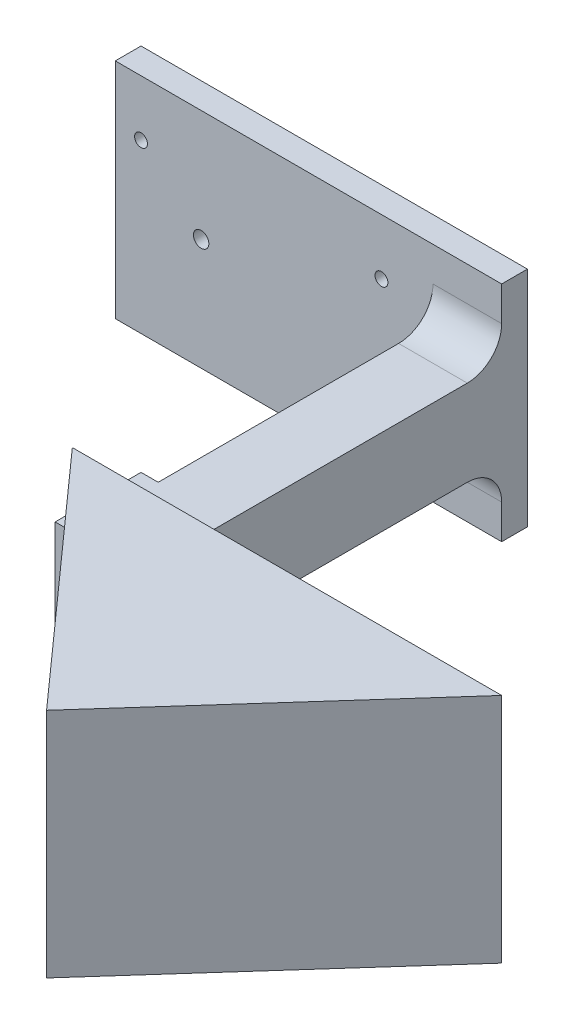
ISO-10303-21;
HEADER;
FILE_DESCRIPTION(('STEP AP214'),'2;1');
FILE_NAME('part.step','',(''),(''),'','','');
FILE_SCHEMA(('AUTOMOTIVE_DESIGN { 1 0 10303 214 1 1 1 1 }'));
ENDSEC;
DATA;
#1=APPLICATION_CONTEXT('core data for automotive mechanical design processes');
#2=APPLICATION_PROTOCOL_DEFINITION('international standard','automotive_design',2000,#1);
#3=PRODUCT_CONTEXT('',#1,'mechanical');
#4=PRODUCT('Part','Part','',(#3));
#5=PRODUCT_RELATED_PRODUCT_CATEGORY('part','',(#4));
#6=PRODUCT_DEFINITION_FORMATION('','',#4);
#7=PRODUCT_DEFINITION_CONTEXT('part definition',#1,'design');
#8=PRODUCT_DEFINITION('design','',#6,#7);
#9=PRODUCT_DEFINITION_SHAPE('','',#8);
#10=(LENGTH_UNIT() NAMED_UNIT(*) SI_UNIT(.MILLI.,.METRE.));
#11=(NAMED_UNIT(*) PLANE_ANGLE_UNIT() SI_UNIT($,.RADIAN.));
#12=(NAMED_UNIT(*) SI_UNIT($,.STERADIAN.) SOLID_ANGLE_UNIT());
#13=UNCERTAINTY_MEASURE_WITH_UNIT(LENGTH_MEASURE(1.E-05),#10,'distance_accuracy_value','');
#14=(GEOMETRIC_REPRESENTATION_CONTEXT(3) GLOBAL_UNCERTAINTY_ASSIGNED_CONTEXT((#13)) GLOBAL_UNIT_ASSIGNED_CONTEXT((#10,
#11,#12)) REPRESENTATION_CONTEXT('',''));
#15=CARTESIAN_POINT('',(0.,0.,0.));
#16=DIRECTION('',(0.,0.,1.));
#17=DIRECTION('',(1.,0.,0.));
#18=AXIS2_PLACEMENT_3D('',#15,#16,#17);
#19=CARTESIAN_POINT('',(37.,18.,45.));
#20=DIRECTION('',(1.,0.,0.));
#21=DIRECTION('',(0.,0.,-1.));
#22=AXIS2_PLACEMENT_3D('',#19,#20,#21);
#23=PLANE('',#22);
#24=DIRECTION('',(0.,0.,-1.));
#25=VECTOR('',#24,1.);
#26=CARTESIAN_POINT('',(37.,18.,45.));
#27=LINE('',#26,#25);
#28=CARTESIAN_POINT('',(37.,18.,45.));
#29=VERTEX_POINT('',#28);
#30=CARTESIAN_POINT('',(37.,18.,41.));
#31=VERTEX_POINT('',#30);
#32=EDGE_CURVE('E220',#29,#31,#27,.T.);
#33=ORIENTED_EDGE('',*,*,#32,.F.);
#34=DIRECTION('',(0.,-1.,0.));
#35=VECTOR('',#34,1.);
#36=CARTESIAN_POINT('',(37.,27.5,45.));
#37=LINE('',#36,#35);
#38=CARTESIAN_POINT('',(37.,22.,45.));
#39=VERTEX_POINT('',#38);
#40=EDGE_CURVE('E262',#39,#29,#37,.T.);
#41=ORIENTED_EDGE('',*,*,#40,.F.);
#42=CARTESIAN_POINT('',(37.,22.,41.));
#43=DIRECTION('',(1.,0.,0.));
#44=DIRECTION('',(0.,0.,-1.));
#45=AXIS2_PLACEMENT_3D('',#42,#43,#44);
#46=CIRCLE('',#45,4.);
#47=EDGE_CURVE('E430',#39,#31,#46,.T.);
#48=ORIENTED_EDGE('',*,*,#47,.T.);
#49=EDGE_LOOP('',(#33,#41,#48));
#50=FACE_BOUND('',#49,.T.);
#51=ADVANCED_FACE('F39',(#50),#23,.F.);
#52=DIRECTION('',(0.,0.,-1.));
#53=VECTOR('',#52,1.);
#54=CARTESIAN_POINT('',(37.,8.,45.));
#55=LINE('',#54,#53);
#56=CARTESIAN_POINT('',(37.,8.,35.));
#57=VERTEX_POINT('',#56);
#58=CARTESIAN_POINT('',(37.,8.,7.00000000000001));
#59=VERTEX_POINT('',#58);
#60=EDGE_CURVE('E297',#57,#59,#55,.T.);
#61=ORIENTED_EDGE('',*,*,#60,.F.);
#62=DIRECTION('',(0.,1.,0.));
#63=VECTOR('',#62,1.);
#64=CARTESIAN_POINT('',(37.,18.,35.));
#65=LINE('',#64,#63);
#66=CARTESIAN_POINT('',(37.,18.,35.));
#67=VERTEX_POINT('',#66);
#68=EDGE_CURVE('E62',#57,#67,#65,.T.);
#69=ORIENTED_EDGE('',*,*,#68,.T.);
#70=DIRECTION('',(0.,0.,-1.));
#71=VECTOR('',#70,1.);
#72=CARTESIAN_POINT('',(37.,18.,45.));
#73=LINE('',#72,#71);
#74=CARTESIAN_POINT('',(37.,18.,7.00000000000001));
#75=VERTEX_POINT('',#74);
#76=EDGE_CURVE('E205',#67,#75,#73,.T.);
#77=ORIENTED_EDGE('',*,*,#76,.T.);
#78=CARTESIAN_POINT('',(37.,22.,7.));
#79=DIRECTION('',(1.,0.,0.));
#80=DIRECTION('',(0.,0.,-1.));
#81=AXIS2_PLACEMENT_3D('',#78,#79,#80);
#82=CIRCLE('',#81,4.);
#83=CARTESIAN_POINT('',(37.,22.,3.));
#84=VERTEX_POINT('',#83);
#85=EDGE_CURVE('E576',#75,#84,#82,.T.);
#86=ORIENTED_EDGE('',*,*,#85,.T.);
#87=DIRECTION('',(0.,-1.,0.));
#88=VECTOR('',#87,1.);
#89=CARTESIAN_POINT('',(37.,18.,3.));
#90=LINE('',#89,#88);
#91=CARTESIAN_POINT('',(37.,4.,3.));
#92=VERTEX_POINT('',#91);
#93=EDGE_CURVE('E287',#84,#92,#90,.T.);
#94=ORIENTED_EDGE('',*,*,#93,.T.);
#95=CARTESIAN_POINT('',(37.,4.,7.));
#96=DIRECTION('',(1.,0.,0.));
#97=DIRECTION('',(0.,0.,-1.));
#98=AXIS2_PLACEMENT_3D('',#95,#96,#97);
#99=CIRCLE('',#98,4.);
#100=EDGE_CURVE('E580',#92,#59,#99,.T.);
#101=ORIENTED_EDGE('',*,*,#100,.T.);
#102=EDGE_LOOP('',(#61,#69,#77,#86,#94,#101));
#103=FACE_BOUND('',#102,.T.);
#104=ADVANCED_FACE('F468',(#103),#23,.F.);
#105=CARTESIAN_POINT('',(37.,8.,45.));
#106=DIRECTION('',(0.,1.,0.));
#107=DIRECTION('',(0.,0.,1.));
#108=AXIS2_PLACEMENT_3D('',#105,#106,#107);
#109=PLANE('',#108);
#110=DIRECTION('',(1.,0.,0.));
#111=VECTOR('',#110,1.);
#112=CARTESIAN_POINT('',(35.,8.,35.));
#113=LINE('',#112,#111);
#114=CARTESIAN_POINT('',(45.,8.,35.));
#115=VERTEX_POINT('',#114);
#116=EDGE_CURVE('E223',#57,#115,#113,.T.);
#117=ORIENTED_EDGE('',*,*,#116,.F.);
#118=ORIENTED_EDGE('',*,*,#60,.T.);
#119=DIRECTION('',(1.,0.,0.));
#120=VECTOR('',#119,1.);
#121=CARTESIAN_POINT('',(45.,8.,7.));
#122=LINE('',#121,#120);
#123=CARTESIAN_POINT('',(45.,8.,7.00000000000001));
#124=VERTEX_POINT('',#123);
#125=EDGE_CURVE('E401',#59,#124,#122,.T.);
#126=ORIENTED_EDGE('',*,*,#125,.T.);
#127=DIRECTION('',(0.,0.,-1.));
#128=VECTOR('',#127,1.);
#129=CARTESIAN_POINT('',(45.,8.,45.));
#130=LINE('',#129,#128);
#131=EDGE_CURVE('E55',#115,#124,#130,.T.);
#132=ORIENTED_EDGE('',*,*,#131,.F.);
#133=EDGE_LOOP('',(#117,#118,#126,#132));
#134=FACE_BOUND('',#133,.T.);
#135=ADVANCED_FACE('F474',(#134),#109,.F.);
#136=DIRECTION('',(0.,0.,1.));
#137=VECTOR('',#136,1.);
#138=CARTESIAN_POINT('',(45.,8.,45.));
#139=LINE('',#138,#137);
#140=CARTESIAN_POINT('',(45.,8.,40.));
#141=VERTEX_POINT('',#140);
#142=CARTESIAN_POINT('',(45.,8.,41.));
#143=VERTEX_POINT('',#142);
#144=EDGE_CURVE('E227',#141,#143,#139,.T.);
#145=ORIENTED_EDGE('',*,*,#144,.F.);
#146=CARTESIAN_POINT('',(50.,8.,40.));
#147=DIRECTION('',(0.,1.,0.));
#148=DIRECTION('',(0.,0.,1.));
#149=AXIS2_PLACEMENT_3D('',#146,#147,#148);
#150=CIRCLE('',#149,5.);
#151=CARTESIAN_POINT('',(45.1010205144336,8.,41.));
#152=VERTEX_POINT('',#151);
#153=EDGE_CURVE('E390',#141,#152,#150,.T.);
#154=ORIENTED_EDGE('',*,*,#153,.T.);
#155=DIRECTION('',(1.,0.,0.));
#156=VECTOR('',#155,1.);
#157=CARTESIAN_POINT('',(37.,8.,41.));
#158=LINE('',#157,#156);
#159=EDGE_CURVE('E404',#152,#143,#158,.F.);
#160=ORIENTED_EDGE('',*,*,#159,.T.);
#161=EDGE_LOOP('',(#145,#154,#160));
#162=FACE_BOUND('',#161,.T.);
#163=ADVANCED_FACE('F550',(#162),#109,.F.);
#164=CARTESIAN_POINT('',(0.,0.,45.));
#165=DIRECTION('',(0.,0.,1.));
#166=DIRECTION('',(1.,0.,0.));
#167=AXIS2_PLACEMENT_3D('',#164,#165,#166);
#168=PLANE('',#167);
#169=DIRECTION('',(0.,1.,0.));
#170=VECTOR('',#169,1.);
#171=CARTESIAN_POINT('',(45.,-3.,45.));
#172=LINE('',#171,#170);
#173=CARTESIAN_POINT('',(45.,-0.5,45.));
#174=VERTEX_POINT('',#173);
#175=CARTESIAN_POINT('',(45.,4.,45.));
#176=VERTEX_POINT('',#175);
#177=EDGE_CURVE('E243',#174,#176,#172,.T.);
#178=ORIENTED_EDGE('',*,*,#177,.T.);
#179=DIRECTION('',(1.,0.,0.));
#180=VECTOR('',#179,1.);
#181=CARTESIAN_POINT('',(50.,4.,45.));
#182=LINE('',#181,#180);
#183=CARTESIAN_POINT('',(50.,4.,45.));
#184=VERTEX_POINT('',#183);
#185=EDGE_CURVE('E398',#176,#184,#182,.T.);
#186=ORIENTED_EDGE('',*,*,#185,.T.);
#187=DIRECTION('',(0.,1.,0.));
#188=VECTOR('',#187,1.);
#189=CARTESIAN_POINT('',(50.,18.,45.));
#190=LINE('',#189,#188);
#191=CARTESIAN_POINT('',(50.,22.,45.));
#192=VERTEX_POINT('',#191);
#193=EDGE_CURVE('E380',#184,#192,#190,.T.);
#194=ORIENTED_EDGE('',*,*,#193,.T.);
#195=DIRECTION('',(-1.,0.,0.));
#196=VECTOR('',#195,1.);
#197=CARTESIAN_POINT('',(37.,22.,45.));
#198=LINE('',#197,#196);
#199=EDGE_CURVE('E394',#192,#39,#198,.T.);
#200=ORIENTED_EDGE('',*,*,#199,.T.);
#201=DIRECTION('',(0.,-1.,0.));
#202=VECTOR('',#201,1.);
#203=CARTESIAN_POINT('',(37.,26.5,45.));
#204=LINE('',#203,#202);
#205=CARTESIAN_POINT('',(37.,26.5,45.));
#206=VERTEX_POINT('',#205);
#207=EDGE_CURVE('E271',#206,#39,#204,.T.);
#208=ORIENTED_EDGE('',*,*,#207,.F.);
#209=DIRECTION('',(-1.,0.,0.));
#210=VECTOR('',#209,1.);
#211=CARTESIAN_POINT('',(37.,26.5,45.));
#212=LINE('',#211,#210);
#213=CARTESIAN_POINT('',(87.,26.5,45.));
#214=VERTEX_POINT('',#213);
#215=EDGE_CURVE('E283',#214,#206,#212,.T.);
#216=ORIENTED_EDGE('',*,*,#215,.F.);
#217=DIRECTION('',(0.,1.,0.));
#218=VECTOR('',#217,1.);
#219=CARTESIAN_POINT('',(87.,26.5,45.));
#220=LINE('',#219,#218);
#221=CARTESIAN_POINT('',(87.,-0.5,45.));
#222=VERTEX_POINT('',#221);
#223=EDGE_CURVE('E280',#222,#214,#220,.T.);
#224=ORIENTED_EDGE('',*,*,#223,.F.);
#225=DIRECTION('',(1.,0.,0.));
#226=VECTOR('',#225,1.);
#227=CARTESIAN_POINT('',(37.,-0.5,45.));
#228=LINE('',#227,#226);
#229=EDGE_CURVE('E275',#174,#222,#228,.T.);
#230=ORIENTED_EDGE('',*,*,#229,.F.);
#231=EDGE_LOOP('',(#178,#186,#194,#200,#208,#216,#224,#230));
#232=FACE_BOUND('',#231,.T.);
#233=ADVANCED_FACE('F542',(#232),#168,.F.);
#234=CARTESIAN_POINT('',(0.,4.,41.));
#235=DIRECTION('',(-1.,0.,0.));
#236=DIRECTION('',(0.,0.,1.));
#237=AXIS2_PLACEMENT_3D('',#234,#235,#236);
#238=CYLINDRICAL_SURFACE('',#237,4.);
#239=CARTESIAN_POINT('',(45.,4.,41.));
#240=DIRECTION('',(-1.,0.,0.));
#241=DIRECTION('',(0.,0.,1.));
#242=AXIS2_PLACEMENT_3D('',#239,#240,#241);
#243=CIRCLE('',#242,4.);
#244=EDGE_CURVE('E11',#143,#176,#243,.F.);
#245=ORIENTED_EDGE('',*,*,#244,.F.);
#246=ORIENTED_EDGE('',*,*,#159,.F.);
#247=CARTESIAN_POINT('',(45.1010205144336,8.,41.));
#248=CARTESIAN_POINT('',(45.1219581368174,8.00002148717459,41.1027017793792));
#249=CARTESIAN_POINT('',(45.1461658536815,7.99604592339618,41.2046920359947));
#250=CARTESIAN_POINT('',(45.2007183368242,7.98058689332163,41.4063145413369));
#251=CARTESIAN_POINT('',(45.2310558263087,7.96911229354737,41.5059494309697));
#252=CARTESIAN_POINT('',(45.2972108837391,7.93927673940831,41.7012719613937));
#253=CARTESIAN_POINT('',(45.332975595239,7.92097996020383,41.7969874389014));
#254=CARTESIAN_POINT('',(45.4097149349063,7.87806419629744,41.9848403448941));
#255=CARTESIAN_POINT('',(45.4506909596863,7.85344351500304,42.0769768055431));
#256=CARTESIAN_POINT('',(45.5802965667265,7.77123638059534,42.3464299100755));
#257=CARTESIAN_POINT('',(45.6759740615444,7.70512970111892,42.5178634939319));
#258=CARTESIAN_POINT('',(45.8823757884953,7.55467704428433,42.8429707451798));
#259=CARTESIAN_POINT('',(45.9931390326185,7.47028343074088,42.9965963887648));
#260=CARTESIAN_POINT('',(46.2884681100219,7.23850961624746,43.3623429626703));
#261=CARTESIAN_POINT('',(46.4809432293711,7.0815090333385,43.5620916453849));
#262=CARTESIAN_POINT('',(46.7830960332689,6.82941253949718,43.8301146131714));
#263=CARTESIAN_POINT('',(46.8862185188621,6.74247147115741,43.9142913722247));
#264=CARTESIAN_POINT('',(47.0962268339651,6.56395665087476,44.0725124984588));
#265=CARTESIAN_POINT('',(47.2031126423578,6.472382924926,44.146556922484));
#266=CARTESIAN_POINT('',(47.4601841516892,6.25077587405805,44.3105047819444));
#267=CARTESIAN_POINT('',(47.6117053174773,6.11909219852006,44.3960820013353));
#268=CARTESIAN_POINT('',(47.9189902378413,5.85047083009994,44.5496051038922));
#269=CARTESIAN_POINT('',(48.07475552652,5.71353122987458,44.6175445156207));
#270=CARTESIAN_POINT('',(48.3891939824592,5.43598395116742,44.7364036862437));
#271=CARTESIAN_POINT('',(48.5478643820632,5.29537971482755,44.7873388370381));
#272=CARTESIAN_POINT('',(48.8672162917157,5.01164100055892,44.8727953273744));
#273=CARTESIAN_POINT('',(49.0278975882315,4.86850679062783,44.9073183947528));
#274=CARTESIAN_POINT('',(49.4548549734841,4.4875876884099,44.9774728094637));
#275=CARTESIAN_POINT('',(49.7223206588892,4.24836389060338,44.9994259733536));
#276=CARTESIAN_POINT('',(49.9929727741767,4.00628534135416,44.9999962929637));
#277=CARTESIAN_POINT('',(49.9964864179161,4.00314264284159,44.9999999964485));
#278=CARTESIAN_POINT('',(50.,4.,45.));
#279=B_SPLINE_CURVE_WITH_KNOTS('',3,(#247,#248,#249,#250,#251,#252,#253,#254,#255,#256,#257,
#258,#259,#260,#261,#262,#263,#264,#265,#266,#267,#268,#269,#270,#271,#272,#273,#274,#275,#276,
#277,#278),.UNSPECIFIED.,.F.,.F.,(4,2,2,2,2,2,2,2,2,2,2,2,2,2,2,4),(0.,0.314249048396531,
0.628127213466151,0.93912435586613,1.25020502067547,1.8689625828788,2.48935176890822,
3.43985889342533,3.91654501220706,4.39322845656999,5.04698520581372,5.70098148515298,
6.35438416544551,7.00771804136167,8.08291184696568,8.09705398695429),.UNSPECIFIED.);
#280=EDGE_CURVE('E421',#184,#152,#279,.F.);
#281=ORIENTED_EDGE('',*,*,#280,.F.);
#282=ORIENTED_EDGE('',*,*,#185,.F.);
#283=EDGE_LOOP('',(#245,#246,#281,#282));
#284=FACE_BOUND('',#283,.T.);
#285=ADVANCED_FACE('F432',(#284),#238,.F.);
#286=CARTESIAN_POINT('',(0.,0.,3.));
#287=DIRECTION('',(0.,0.,-1.));
#288=DIRECTION('',(-1.,0.,0.));
#289=AXIS2_PLACEMENT_3D('',#286,#287,#288);
#290=PLANE('',#289);
#291=CARTESIAN_POINT('',(3.,19.5,3.));
#292=DIRECTION('',(0.,0.,1.));
#293=DIRECTION('',(1.,0.,0.));
#294=AXIS2_PLACEMENT_3D('',#291,#292,#293);
#295=CIRCLE('',#294,0.75);
#296=CARTESIAN_POINT('',(3.75,19.5,3.));
#297=VERTEX_POINT('',#296);
#298=EDGE_CURVE('E301',#297,#297,#295,.T.);
#299=ORIENTED_EDGE('',*,*,#298,.F.);
#300=EDGE_LOOP('',(#299));
#301=FACE_BOUND('',#300,.T.);
#302=CARTESIAN_POINT('',(31.,19.5,3.));
#303=DIRECTION('',(0.,0.,1.));
#304=DIRECTION('',(1.,0.,0.));
#305=AXIS2_PLACEMENT_3D('',#302,#303,#304);
#306=CIRCLE('',#305,0.749999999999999);
#307=CARTESIAN_POINT('',(31.75,19.5,3.));
#308=VERTEX_POINT('',#307);
#309=EDGE_CURVE('E309',#308,#308,#306,.T.);
#310=ORIENTED_EDGE('',*,*,#309,.F.);
#311=EDGE_LOOP('',(#310));
#312=FACE_BOUND('',#311,.T.);
#313=CARTESIAN_POINT('',(34.,13.,3.));
#314=DIRECTION('',(0.,0.,1.));
#315=DIRECTION('',(1.,0.,0.));
#316=AXIS2_PLACEMENT_3D('',#313,#314,#315);
#317=CIRCLE('',#316,0.899999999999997);
#318=CARTESIAN_POINT('',(34.9,13.,3.));
#319=VERTEX_POINT('',#318);
#320=EDGE_CURVE('E317',#319,#319,#317,.T.);
#321=ORIENTED_EDGE('',*,*,#320,.F.);
#322=EDGE_LOOP('',(#321));
#323=FACE_BOUND('',#322,.T.);
#324=CARTESIAN_POINT('',(10.,13.,3.));
#325=DIRECTION('',(0.,0.,1.));
#326=DIRECTION('',(1.,0.,0.));
#327=AXIS2_PLACEMENT_3D('',#324,#325,#326);
#328=CIRCLE('',#327,0.900000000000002);
#329=CARTESIAN_POINT('',(10.9,13.,3.));
#330=VERTEX_POINT('',#329);
#331=EDGE_CURVE('E325',#330,#330,#328,.T.);
#332=ORIENTED_EDGE('',*,*,#331,.F.);
#333=EDGE_LOOP('',(#332));
#334=FACE_BOUND('',#333,.T.);
#335=DIRECTION('',(0.,1.,0.));
#336=VECTOR('',#335,1.);
#337=CARTESIAN_POINT('',(45.,0.,3.));
#338=LINE('',#337,#336);
#339=CARTESIAN_POINT('',(45.,0.,3.));
#340=VERTEX_POINT('',#339);
#341=CARTESIAN_POINT('',(45.,4.,3.));
#342=VERTEX_POINT('',#341);
#343=EDGE_CURVE('E342',#340,#342,#338,.T.);
#344=ORIENTED_EDGE('',*,*,#343,.T.);
#345=DIRECTION('',(1.,0.,0.));
#346=VECTOR('',#345,1.);
#347=CARTESIAN_POINT('',(37.,4.,3.));
#348=LINE('',#347,#346);
#349=EDGE_CURVE('E417',#342,#92,#348,.F.);
#350=ORIENTED_EDGE('',*,*,#349,.T.);
#351=ORIENTED_EDGE('',*,*,#93,.F.);
#352=DIRECTION('',(-1.,0.,0.));
#353=VECTOR('',#352,1.);
#354=CARTESIAN_POINT('',(45.,22.,3.));
#355=LINE('',#354,#353);
#356=CARTESIAN_POINT('',(45.,22.,3.));
#357=VERTEX_POINT('',#356);
#358=EDGE_CURVE('E414',#84,#357,#355,.F.);
#359=ORIENTED_EDGE('',*,*,#358,.T.);
#360=CARTESIAN_POINT('',(45.,26.,3.));
#361=VERTEX_POINT('',#360);
#362=EDGE_CURVE('E341',#357,#361,#338,.T.);
#363=ORIENTED_EDGE('',*,*,#362,.T.);
#364=DIRECTION('',(-1.,0.,0.));
#365=VECTOR('',#364,1.);
#366=CARTESIAN_POINT('',(0.,26.,3.));
#367=LINE('',#366,#365);
#368=CARTESIAN_POINT('',(0.,26.,3.));
#369=VERTEX_POINT('',#368);
#370=EDGE_CURVE('E346',#361,#369,#367,.T.);
#371=ORIENTED_EDGE('',*,*,#370,.T.);
#372=DIRECTION('',(0.,-1.,0.));
#373=VECTOR('',#372,1.);
#374=CARTESIAN_POINT('',(0.,0.,3.));
#375=LINE('',#374,#373);
#376=CARTESIAN_POINT('',(0.,0.,3.));
#377=VERTEX_POINT('',#376);
#378=EDGE_CURVE('E333',#369,#377,#375,.T.);
#379=ORIENTED_EDGE('',*,*,#378,.T.);
#380=DIRECTION('',(1.,0.,0.));
#381=VECTOR('',#380,1.);
#382=CARTESIAN_POINT('',(0.,0.,3.));
#383=LINE('',#382,#381);
#384=EDGE_CURVE('E337',#377,#340,#383,.T.);
#385=ORIENTED_EDGE('',*,*,#384,.T.);
#386=EDGE_LOOP('',(#344,#350,#351,#359,#363,#371,#379,#385));
#387=FACE_BOUND('',#386,.T.);
#388=ADVANCED_FACE('F497',(#301,#312,#323,#334,#387),#290,.F.);
#389=CARTESIAN_POINT('',(0.,0.,0.));
#390=DIRECTION('',(0.,0.,-1.));
#391=DIRECTION('',(-1.,0.,0.));
#392=AXIS2_PLACEMENT_3D('',#389,#390,#391);
#393=PLANE('',#392);
#394=CARTESIAN_POINT('',(31.,19.5,0.));
#395=DIRECTION('',(0.,0.,1.));
#396=DIRECTION('',(1.,0.,0.));
#397=AXIS2_PLACEMENT_3D('',#394,#395,#396);
#398=CIRCLE('',#397,0.749999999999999);
#399=CARTESIAN_POINT('',(31.75,19.5,0.));
#400=VERTEX_POINT('',#399);
#401=EDGE_CURVE('E305',#400,#400,#398,.T.);
#402=ORIENTED_EDGE('',*,*,#401,.T.);
#403=EDGE_LOOP('',(#402));
#404=FACE_BOUND('',#403,.T.);
#405=CARTESIAN_POINT('',(10.,13.,0.));
#406=DIRECTION('',(0.,0.,1.));
#407=DIRECTION('',(1.,0.,0.));
#408=AXIS2_PLACEMENT_3D('',#405,#406,#407);
#409=CIRCLE('',#408,0.900000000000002);
#410=CARTESIAN_POINT('',(10.9,13.,0.));
#411=VERTEX_POINT('',#410);
#412=EDGE_CURVE('E321',#411,#411,#409,.T.);
#413=ORIENTED_EDGE('',*,*,#412,.T.);
#414=EDGE_LOOP('',(#413));
#415=FACE_BOUND('',#414,.T.);
#416=DIRECTION('',(0.,-1.,0.));
#417=VECTOR('',#416,1.);
#418=CARTESIAN_POINT('',(0.,0.,0.));
#419=LINE('',#418,#417);
#420=CARTESIAN_POINT('',(0.,26.,0.));
#421=VERTEX_POINT('',#420);
#422=CARTESIAN_POINT('',(0.,0.,0.));
#423=VERTEX_POINT('',#422);
#424=EDGE_CURVE('E329',#421,#423,#419,.T.);
#425=ORIENTED_EDGE('',*,*,#424,.F.);
#426=DIRECTION('',(-1.,0.,0.));
#427=VECTOR('',#426,1.);
#428=CARTESIAN_POINT('',(0.,26.,0.));
#429=LINE('',#428,#427);
#430=CARTESIAN_POINT('',(45.,26.,0.));
#431=VERTEX_POINT('',#430);
#432=EDGE_CURVE('E338',#431,#421,#429,.T.);
#433=ORIENTED_EDGE('',*,*,#432,.F.);
#434=DIRECTION('',(0.,1.,0.));
#435=VECTOR('',#434,1.);
#436=CARTESIAN_POINT('',(45.,0.,0.));
#437=LINE('',#436,#435);
#438=CARTESIAN_POINT('',(45.,0.,0.));
#439=VERTEX_POINT('',#438);
#440=EDGE_CURVE('E356',#439,#431,#437,.T.);
#441=ORIENTED_EDGE('',*,*,#440,.F.);
#442=DIRECTION('',(1.,0.,0.));
#443=VECTOR('',#442,1.);
#444=CARTESIAN_POINT('',(0.,0.,0.));
#445=LINE('',#444,#443);
#446=EDGE_CURVE('E353',#423,#439,#445,.T.);
#447=ORIENTED_EDGE('',*,*,#446,.F.);
#448=EDGE_LOOP('',(#425,#433,#441,#447));
#449=FACE_BOUND('',#448,.T.);
#450=CARTESIAN_POINT('',(34.,13.,0.));
#451=DIRECTION('',(0.,0.,1.));
#452=DIRECTION('',(1.,0.,0.));
#453=AXIS2_PLACEMENT_3D('',#450,#451,#452);
#454=CIRCLE('',#453,0.899999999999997);
#455=CARTESIAN_POINT('',(34.9,13.,0.));
#456=VERTEX_POINT('',#455);
#457=EDGE_CURVE('E313',#456,#456,#454,.T.);
#458=ORIENTED_EDGE('',*,*,#457,.T.);
#459=EDGE_LOOP('',(#458));
#460=FACE_BOUND('',#459,.T.);
#461=CARTESIAN_POINT('',(3.,19.5,0.));
#462=DIRECTION('',(0.,0.,1.));
#463=DIRECTION('',(1.,0.,0.));
#464=AXIS2_PLACEMENT_3D('',#461,#462,#463);
#465=CIRCLE('',#464,0.75);
#466=CARTESIAN_POINT('',(3.75,19.5,0.));
#467=VERTEX_POINT('',#466);
#468=EDGE_CURVE('E300',#467,#467,#465,.T.);
#469=ORIENTED_EDGE('',*,*,#468,.T.);
#470=EDGE_LOOP('',(#469));
#471=FACE_BOUND('',#470,.T.);
#472=ADVANCED_FACE('F500',(#404,#415,#449,#460,#471),#393,.T.);
#473=CARTESIAN_POINT('',(0.,0.,3.));
#474=DIRECTION('',(1.,0.,0.));
#475=DIRECTION('',(0.,0.,-1.));
#476=AXIS2_PLACEMENT_3D('',#473,#474,#475);
#477=PLANE('',#476);
#478=ORIENTED_EDGE('',*,*,#424,.T.);
#479=DIRECTION('',(0.,0.,-1.));
#480=VECTOR('',#479,1.);
#481=CARTESIAN_POINT('',(0.,0.,3.));
#482=LINE('',#481,#480);
#483=EDGE_CURVE('E372',#377,#423,#482,.T.);
#484=ORIENTED_EDGE('',*,*,#483,.F.);
#485=ORIENTED_EDGE('',*,*,#378,.F.);
#486=DIRECTION('',(0.,0.,-1.));
#487=VECTOR('',#486,1.);
#488=CARTESIAN_POINT('',(0.,26.,3.));
#489=LINE('',#488,#487);
#490=EDGE_CURVE('E349',#369,#421,#489,.T.);
#491=ORIENTED_EDGE('',*,*,#490,.T.);
#492=EDGE_LOOP('',(#478,#484,#485,#491));
#493=FACE_BOUND('',#492,.T.);
#494=ADVANCED_FACE('F442',(#493),#477,.F.);
#495=CARTESIAN_POINT('',(0.,0.,3.));
#496=DIRECTION('',(0.,1.,0.));
#497=DIRECTION('',(0.,0.,1.));
#498=AXIS2_PLACEMENT_3D('',#495,#496,#497);
#499=PLANE('',#498);
#500=ORIENTED_EDGE('',*,*,#446,.T.);
#501=DIRECTION('',(0.,0.,-1.));
#502=VECTOR('',#501,1.);
#503=CARTESIAN_POINT('',(45.,0.,3.));
#504=LINE('',#503,#502);
#505=EDGE_CURVE('E368',#340,#439,#504,.T.);
#506=ORIENTED_EDGE('',*,*,#505,.F.);
#507=ORIENTED_EDGE('',*,*,#384,.F.);
#508=ORIENTED_EDGE('',*,*,#483,.T.);
#509=EDGE_LOOP('',(#500,#506,#507,#508));
#510=FACE_BOUND('',#509,.T.);
#511=ADVANCED_FACE('F510',(#510),#499,.F.);
#512=CARTESIAN_POINT('',(45.,0.,3.));
#513=DIRECTION('',(-1.,0.,0.));
#514=DIRECTION('',(0.,0.,1.));
#515=AXIS2_PLACEMENT_3D('',#512,#513,#514);
#516=PLANE('',#515);
#517=DIRECTION('',(0.,1.,0.));
#518=VECTOR('',#517,1.);
#519=CARTESIAN_POINT('',(45.,-3.,35.));
#520=LINE('',#519,#518);
#521=CARTESIAN_POINT('',(45.,-3.,35.));
#522=VERTEX_POINT('',#521);
#523=EDGE_CURVE('E196',#522,#115,#520,.T.);
#524=ORIENTED_EDGE('',*,*,#523,.T.);
#525=ORIENTED_EDGE('',*,*,#131,.T.);
#526=CARTESIAN_POINT('',(45.,4.,7.));
#527=DIRECTION('',(-1.,0.,0.));
#528=DIRECTION('',(0.,0.,1.));
#529=AXIS2_PLACEMENT_3D('',#526,#527,#528);
#530=CIRCLE('',#529,4.);
#531=EDGE_CURVE('E453',#124,#342,#530,.T.);
#532=ORIENTED_EDGE('',*,*,#531,.T.);
#533=ORIENTED_EDGE('',*,*,#343,.F.);
#534=ORIENTED_EDGE('',*,*,#505,.T.);
#535=ORIENTED_EDGE('',*,*,#440,.T.);
#536=DIRECTION('',(0.,0.,-1.));
#537=VECTOR('',#536,1.);
#538=CARTESIAN_POINT('',(45.,26.,3.));
#539=LINE('',#538,#537);
#540=EDGE_CURVE('E364',#361,#431,#539,.T.);
#541=ORIENTED_EDGE('',*,*,#540,.F.);
#542=ORIENTED_EDGE('',*,*,#362,.F.);
#543=CARTESIAN_POINT('',(45.,22.,7.));
#544=DIRECTION('',(-1.,0.,0.));
#545=DIRECTION('',(0.,0.,1.));
#546=AXIS2_PLACEMENT_3D('',#543,#544,#545);
#547=CIRCLE('',#546,4.);
#548=CARTESIAN_POINT('',(45.,18.,7.00000000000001));
#549=VERTEX_POINT('',#548);
#550=EDGE_CURVE('E48',#357,#549,#547,.T.);
#551=ORIENTED_EDGE('',*,*,#550,.T.);
#552=DIRECTION('',(0.,0.,-1.));
#553=VECTOR('',#552,1.);
#554=CARTESIAN_POINT('',(45.,18.,45.));
#555=LINE('',#554,#553);
#556=CARTESIAN_POINT('',(45.,18.,40.));
#557=VERTEX_POINT('',#556);
#558=EDGE_CURVE('E292',#557,#549,#555,.T.);
#559=ORIENTED_EDGE('',*,*,#558,.F.);
#560=DIRECTION('',(0.,1.,0.));
#561=VECTOR('',#560,1.);
#562=CARTESIAN_POINT('',(45.,8.,40.));
#563=LINE('',#562,#561);
#564=EDGE_CURVE('E383',#557,#141,#563,.F.);
#565=ORIENTED_EDGE('',*,*,#564,.T.);
#566=ORIENTED_EDGE('',*,*,#144,.T.);
#567=ORIENTED_EDGE('',*,*,#244,.T.);
#568=ORIENTED_EDGE('',*,*,#177,.F.);
#569=CARTESIAN_POINT('',(45.,-3.,45.));
#570=VERTEX_POINT('',#569);
#571=EDGE_CURVE('E244',#570,#174,#172,.T.);
#572=ORIENTED_EDGE('',*,*,#571,.F.);
#573=DIRECTION('',(0.,0.,1.));
#574=VECTOR('',#573,1.);
#575=CARTESIAN_POINT('',(45.,-3.,45.));
#576=LINE('',#575,#574);
#577=EDGE_CURVE('E230',#522,#570,#576,.T.);
#578=ORIENTED_EDGE('',*,*,#577,.F.);
#579=EDGE_LOOP('',(#524,#525,#532,#533,#534,#535,#541,#542,#551,#559,#565,#566,#567,#568,#572,#578));
#580=FACE_BOUND('',#579,.T.);
#581=ADVANCED_FACE('F507',(#580),#516,.F.);
#582=CARTESIAN_POINT('',(0.,26.,3.));
#583=DIRECTION('',(0.,-1.,0.));
#584=DIRECTION('',(0.,0.,-1.));
#585=AXIS2_PLACEMENT_3D('',#582,#583,#584);
#586=PLANE('',#585);
#587=ORIENTED_EDGE('',*,*,#432,.T.);
#588=ORIENTED_EDGE('',*,*,#490,.F.);
#589=ORIENTED_EDGE('',*,*,#370,.F.);
#590=ORIENTED_EDGE('',*,*,#540,.T.);
#591=EDGE_LOOP('',(#587,#588,#589,#590));
#592=FACE_BOUND('',#591,.T.);
#593=ADVANCED_FACE('F495',(#592),#586,.F.);
#594=CARTESIAN_POINT('',(10.,13.,3.));
#595=DIRECTION('',(0.,0.,-1.));
#596=DIRECTION('',(-1.,0.,0.));
#597=AXIS2_PLACEMENT_3D('',#594,#595,#596);
#598=CYLINDRICAL_SURFACE('',#597,0.900000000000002);
#599=ORIENTED_EDGE('',*,*,#331,.T.);
#600=EDGE_LOOP('',(#599));
#601=FACE_BOUND('',#600,.T.);
#602=ORIENTED_EDGE('',*,*,#412,.F.);
#603=EDGE_LOOP('',(#602));
#604=FACE_BOUND('',#603,.T.);
#605=ADVANCED_FACE('F491',(#601,#604),#598,.F.);
#606=CARTESIAN_POINT('',(34.,13.,3.));
#607=DIRECTION('',(0.,0.,-1.));
#608=DIRECTION('',(-1.,0.,0.));
#609=AXIS2_PLACEMENT_3D('',#606,#607,#608);
#610=CYLINDRICAL_SURFACE('',#609,0.899999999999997);
#611=ORIENTED_EDGE('',*,*,#320,.T.);
#612=EDGE_LOOP('',(#611));
#613=FACE_BOUND('',#612,.T.);
#614=ORIENTED_EDGE('',*,*,#457,.F.);
#615=EDGE_LOOP('',(#614));
#616=FACE_BOUND('',#615,.T.);
#617=ADVANCED_FACE('F487',(#613,#616),#610,.F.);
#618=CARTESIAN_POINT('',(31.,19.5,3.));
#619=DIRECTION('',(0.,0.,-1.));
#620=DIRECTION('',(-1.,0.,0.));
#621=AXIS2_PLACEMENT_3D('',#618,#619,#620);
#622=CYLINDRICAL_SURFACE('',#621,0.749999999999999);
#623=ORIENTED_EDGE('',*,*,#309,.T.);
#624=EDGE_LOOP('',(#623));
#625=FACE_BOUND('',#624,.T.);
#626=ORIENTED_EDGE('',*,*,#401,.F.);
#627=EDGE_LOOP('',(#626));
#628=FACE_BOUND('',#627,.T.);
#629=ADVANCED_FACE('F483',(#625,#628),#622,.F.);
#630=CARTESIAN_POINT('',(3.,19.5,3.));
#631=DIRECTION('',(0.,0.,-1.));
#632=DIRECTION('',(-1.,0.,0.));
#633=AXIS2_PLACEMENT_3D('',#630,#631,#632);
#634=CYLINDRICAL_SURFACE('',#633,0.75);
#635=ORIENTED_EDGE('',*,*,#298,.T.);
#636=EDGE_LOOP('',(#635));
#637=FACE_BOUND('',#636,.T.);
#638=ORIENTED_EDGE('',*,*,#468,.F.);
#639=EDGE_LOOP('',(#638));
#640=FACE_BOUND('',#639,.T.);
#641=ADVANCED_FACE('F480',(#637,#640),#634,.F.);
#642=CARTESIAN_POINT('',(37.,18.,45.));
#643=DIRECTION('',(0.,-1.,0.));
#644=DIRECTION('',(1.,0.,0.));
#645=AXIS2_PLACEMENT_3D('',#642,#643,#644);
#646=PLANE('',#645);
#647=ORIENTED_EDGE('',*,*,#76,.F.);
#648=DIRECTION('',(1.,0.,0.));
#649=VECTOR('',#648,1.);
#650=CARTESIAN_POINT('',(35.,18.,35.));
#651=LINE('',#650,#649);
#652=CARTESIAN_POINT('',(35.,18.,35.));
#653=VERTEX_POINT('',#652);
#654=EDGE_CURVE('E187',#653,#67,#651,.T.);
#655=ORIENTED_EDGE('',*,*,#654,.F.);
#656=DIRECTION('',(0.,0.,-1.));
#657=VECTOR('',#656,1.);
#658=CARTESIAN_POINT('',(35.,18.,45.));
#659=LINE('',#658,#657);
#660=CARTESIAN_POINT('',(35.,18.,45.));
#661=VERTEX_POINT('',#660);
#662=EDGE_CURVE('E203',#661,#653,#659,.T.);
#663=ORIENTED_EDGE('',*,*,#662,.F.);
#664=DIRECTION('',(-1.,0.,0.));
#665=VECTOR('',#664,1.);
#666=CARTESIAN_POINT('',(35.,18.,45.));
#667=LINE('',#666,#665);
#668=EDGE_CURVE('E207',#29,#661,#667,.T.);
#669=ORIENTED_EDGE('',*,*,#668,.F.);
#670=ORIENTED_EDGE('',*,*,#32,.T.);
#671=DIRECTION('',(-1.,0.,0.));
#672=VECTOR('',#671,1.);
#673=CARTESIAN_POINT('',(50.,18.,41.));
#674=LINE('',#673,#672);
#675=CARTESIAN_POINT('',(45.1010205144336,18.,41.));
#676=VERTEX_POINT('',#675);
#677=EDGE_CURVE('E411',#31,#676,#674,.F.);
#678=ORIENTED_EDGE('',*,*,#677,.T.);
#679=CARTESIAN_POINT('',(50.,18.,40.));
#680=DIRECTION('',(0.,-1.,0.));
#681=DIRECTION('',(1.,0.,0.));
#682=AXIS2_PLACEMENT_3D('',#679,#680,#681);
#683=CIRCLE('',#682,5.);
#684=EDGE_CURVE('E387',#676,#557,#683,.T.);
#685=ORIENTED_EDGE('',*,*,#684,.T.);
#686=ORIENTED_EDGE('',*,*,#558,.T.);
#687=DIRECTION('',(-1.,0.,0.));
#688=VECTOR('',#687,1.);
#689=CARTESIAN_POINT('',(37.,18.,7.));
#690=LINE('',#689,#688);
#691=EDGE_CURVE('E408',#549,#75,#690,.T.);
#692=ORIENTED_EDGE('',*,*,#691,.T.);
#693=EDGE_LOOP('',(#647,#655,#663,#669,#670,#678,#685,#686,#692));
#694=FACE_BOUND('',#693,.T.);
#695=ADVANCED_FACE('F201',(#694),#646,.F.);
#696=CARTESIAN_POINT('',(37.,-0.5,73.));
#697=DIRECTION('',(0.,1.,0.));
#698=DIRECTION('',(0.,0.,1.));
#699=AXIS2_PLACEMENT_3D('',#696,#697,#698);
#700=PLANE('',#699);
#701=CARTESIAN_POINT('',(37.,-0.5,45.));
#702=VERTEX_POINT('',#701);
#703=EDGE_CURVE('E276',#702,#174,#228,.T.);
#704=ORIENTED_EDGE('',*,*,#703,.T.);
#705=ORIENTED_EDGE('',*,*,#229,.T.);
#706=DIRECTION('',(0.666015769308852,0.,-0.745937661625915));
#707=VECTOR('',#706,1.);
#708=CARTESIAN_POINT('',(62.,-0.5,73.));
#709=LINE('',#708,#707);
#710=CARTESIAN_POINT('',(62.,-0.5,73.));
#711=VERTEX_POINT('',#710);
#712=EDGE_CURVE('E195',#711,#222,#709,.T.);
#713=ORIENTED_EDGE('',*,*,#712,.F.);
#714=DIRECTION('',(0.666015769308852,0.,0.745937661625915));
#715=VECTOR('',#714,1.);
#716=CARTESIAN_POINT('',(62.,-0.5,73.));
#717=LINE('',#716,#715);
#718=EDGE_CURVE('E258',#702,#711,#717,.T.);
#719=ORIENTED_EDGE('',*,*,#718,.F.);
#720=EDGE_LOOP('',(#704,#705,#713,#719));
#721=FACE_BOUND('',#720,.T.);
#722=ADVANCED_FACE('F567',(#721),#700,.F.);
#723=CARTESIAN_POINT('',(37.,26.5,73.));
#724=DIRECTION('',(0.,-1.,0.));
#725=DIRECTION('',(0.,0.,-1.));
#726=AXIS2_PLACEMENT_3D('',#723,#724,#725);
#727=PLANE('',#726);
#728=DIRECTION('',(0.666015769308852,0.,0.745937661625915));
#729=VECTOR('',#728,1.);
#730=CARTESIAN_POINT('',(50.9105748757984,26.5,60.5798438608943));
#731=LINE('',#730,#729);
#732=CARTESIAN_POINT('',(62.,26.5,73.));
#733=VERTEX_POINT('',#732);
#734=EDGE_CURVE('E266',#206,#733,#731,.T.);
#735=ORIENTED_EDGE('',*,*,#734,.T.);
#736=DIRECTION('',(0.666015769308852,0.,-0.745937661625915));
#737=VECTOR('',#736,1.);
#738=CARTESIAN_POINT('',(50.9105748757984,26.5,85.4201561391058));
#739=LINE('',#738,#737);
#740=EDGE_CURVE('E254',#733,#214,#739,.T.);
#741=ORIENTED_EDGE('',*,*,#740,.T.);
#742=ORIENTED_EDGE('',*,*,#215,.T.);
#743=EDGE_LOOP('',(#735,#741,#742));
#744=FACE_BOUND('',#743,.T.);
#745=ADVANCED_FACE('F562',(#744),#727,.F.);
#746=CARTESIAN_POINT('',(62.,27.5,73.));
#747=DIRECTION('',(0.745937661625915,0.,-0.666015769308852));
#748=DIRECTION('',(-0.666015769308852,0.,-0.745937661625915));
#749=AXIS2_PLACEMENT_3D('',#746,#747,#748);
#750=PLANE('',#749);
#751=ORIENTED_EDGE('',*,*,#207,.T.);
#752=ORIENTED_EDGE('',*,*,#40,.T.);
#753=EDGE_CURVE('E270',#29,#702,#204,.T.);
#754=ORIENTED_EDGE('',*,*,#753,.T.);
#755=ORIENTED_EDGE('',*,*,#718,.T.);
#756=DIRECTION('',(0.,1.,0.));
#757=VECTOR('',#756,1.);
#758=CARTESIAN_POINT('',(62.,0.,73.));
#759=LINE('',#758,#757);
#760=EDGE_CURVE('E376',#711,#733,#759,.T.);
#761=ORIENTED_EDGE('',*,*,#760,.T.);
#762=ORIENTED_EDGE('',*,*,#734,.F.);
#763=EDGE_LOOP('',(#751,#752,#754,#755,#761,#762));
#764=FACE_BOUND('',#763,.T.);
#765=ADVANCED_FACE('F560',(#764),#750,.F.);
#766=CARTESIAN_POINT('',(62.,27.5,73.));
#767=DIRECTION('',(-0.745937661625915,0.,-0.666015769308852));
#768=DIRECTION('',(-0.666015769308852,0.,0.745937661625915));
#769=AXIS2_PLACEMENT_3D('',#766,#767,#768);
#770=PLANE('',#769);
#771=ORIENTED_EDGE('',*,*,#760,.F.);
#772=ORIENTED_EDGE('',*,*,#712,.T.);
#773=ORIENTED_EDGE('',*,*,#223,.T.);
#774=ORIENTED_EDGE('',*,*,#740,.F.);
#775=EDGE_LOOP('',(#771,#772,#773,#774));
#776=FACE_BOUND('',#775,.T.);
#777=ADVANCED_FACE('F440',(#776),#770,.F.);
#778=CARTESIAN_POINT('',(50.,0.,40.));
#779=DIRECTION('',(0.,-1.,0.));
#780=DIRECTION('',(0.,0.,-1.));
#781=AXIS2_PLACEMENT_3D('',#778,#779,#780);
#782=CYLINDRICAL_SURFACE('',#781,5.);
#783=ORIENTED_EDGE('',*,*,#153,.F.);
#784=ORIENTED_EDGE('',*,*,#564,.F.);
#785=ORIENTED_EDGE('',*,*,#684,.F.);
#786=CARTESIAN_POINT('',(45.1010205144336,18.,41.));
#787=CARTESIAN_POINT('',(45.1219581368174,17.9999785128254,41.1027017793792));
#788=CARTESIAN_POINT('',(45.1461658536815,18.0039540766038,41.2046920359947));
#789=CARTESIAN_POINT('',(45.2007183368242,18.0194131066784,41.4063145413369));
#790=CARTESIAN_POINT('',(45.2310558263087,18.0308877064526,41.5059494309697));
#791=CARTESIAN_POINT('',(45.2972108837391,18.0607232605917,41.7012719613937));
#792=CARTESIAN_POINT('',(45.332975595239,18.0790200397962,41.7969874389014));
#793=CARTESIAN_POINT('',(45.4097149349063,18.1219358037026,41.9848403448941));
#794=CARTESIAN_POINT('',(45.4506909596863,18.146556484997,42.0769768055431));
#795=CARTESIAN_POINT('',(45.5802965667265,18.2287636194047,42.3464299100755));
#796=CARTESIAN_POINT('',(45.6759740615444,18.2948702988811,42.5178634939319));
#797=CARTESIAN_POINT('',(45.8823757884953,18.4453229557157,42.8429707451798));
#798=CARTESIAN_POINT('',(45.9931390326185,18.5297165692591,42.9965963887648));
#799=CARTESIAN_POINT('',(46.2884681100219,18.7614903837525,43.3623429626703));
#800=CARTESIAN_POINT('',(46.4809432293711,18.9184909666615,43.5620916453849));
#801=CARTESIAN_POINT('',(46.7830960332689,19.1705874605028,43.8301146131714));
#802=CARTESIAN_POINT('',(46.8862185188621,19.2575285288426,43.9142913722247));
#803=CARTESIAN_POINT('',(47.0962268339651,19.4360433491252,44.0725124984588));
#804=CARTESIAN_POINT('',(47.2031126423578,19.527617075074,44.146556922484));
#805=CARTESIAN_POINT('',(47.4601841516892,19.7492241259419,44.3105047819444));
#806=CARTESIAN_POINT('',(47.6117053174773,19.8809078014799,44.3960820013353));
#807=CARTESIAN_POINT('',(47.9189902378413,20.1495291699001,44.5496051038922));
#808=CARTESIAN_POINT('',(48.07475552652,20.2864687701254,44.6175445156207));
#809=CARTESIAN_POINT('',(48.3891939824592,20.5640160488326,44.7364036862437));
#810=CARTESIAN_POINT('',(48.5478643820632,20.7046202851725,44.7873388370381));
#811=CARTESIAN_POINT('',(48.8672162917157,20.9883589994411,44.8727953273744));
#812=CARTESIAN_POINT('',(49.0278975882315,21.1314932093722,44.9073183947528));
#813=CARTESIAN_POINT('',(49.4548549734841,21.5124123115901,44.9774728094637));
#814=CARTESIAN_POINT('',(49.7223206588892,21.7516361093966,44.9994259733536));
#815=CARTESIAN_POINT('',(49.9929727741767,21.9937146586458,44.9999962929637));
#816=CARTESIAN_POINT('',(49.9964864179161,21.9968573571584,44.9999999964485));
#817=CARTESIAN_POINT('',(50.,22.,45.));
#818=B_SPLINE_CURVE_WITH_KNOTS('',3,(#786,#787,#788,#789,#790,#791,#792,#793,#794,#795,#796,
#797,#798,#799,#800,#801,#802,#803,#804,#805,#806,#807,#808,#809,#810,#811,#812,#813,#814,#815,
#816,#817),.UNSPECIFIED.,.F.,.F.,(4,2,2,2,2,2,2,2,2,2,2,2,2,2,2,4),(0.,0.314249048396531,
0.62812721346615,0.939124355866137,1.25020502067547,1.8689625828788,2.48935176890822,
3.43985889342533,3.91654501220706,4.39322845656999,5.04698520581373,5.70098148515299,
6.35438416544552,7.00771804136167,8.08291184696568,8.09705398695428),.UNSPECIFIED.);
#819=EDGE_CURVE('E445',#676,#192,#818,.T.);
#820=ORIENTED_EDGE('',*,*,#819,.T.);
#821=ORIENTED_EDGE('',*,*,#193,.F.);
#822=ORIENTED_EDGE('',*,*,#280,.T.);
#823=EDGE_LOOP('',(#783,#784,#785,#820,#821,#822));
#824=FACE_BOUND('',#823,.T.);
#825=ADVANCED_FACE('F435',(#824),#782,.F.);
#826=CARTESIAN_POINT('',(0.,22.,41.));
#827=DIRECTION('',(1.,0.,0.));
#828=DIRECTION('',(0.,1.,0.));
#829=AXIS2_PLACEMENT_3D('',#826,#827,#828);
#830=CYLINDRICAL_SURFACE('',#829,4.);
#831=ORIENTED_EDGE('',*,*,#819,.F.);
#832=ORIENTED_EDGE('',*,*,#677,.F.);
#833=ORIENTED_EDGE('',*,*,#47,.F.);
#834=ORIENTED_EDGE('',*,*,#199,.F.);
#835=EDGE_LOOP('',(#831,#832,#833,#834));
#836=FACE_BOUND('',#835,.T.);
#837=ADVANCED_FACE('F439',(#836),#830,.F.);
#838=CARTESIAN_POINT('',(37.,4.,7.));
#839=DIRECTION('',(-1.,0.,0.));
#840=DIRECTION('',(0.,0.,1.));
#841=AXIS2_PLACEMENT_3D('',#838,#839,#840);
#842=CYLINDRICAL_SURFACE('',#841,4.);
#843=ORIENTED_EDGE('',*,*,#100,.F.);
#844=ORIENTED_EDGE('',*,*,#349,.F.);
#845=ORIENTED_EDGE('',*,*,#531,.F.);
#846=ORIENTED_EDGE('',*,*,#125,.F.);
#847=EDGE_LOOP('',(#843,#844,#845,#846));
#848=FACE_BOUND('',#847,.T.);
#849=ADVANCED_FACE('F457',(#848),#842,.F.);
#850=CARTESIAN_POINT('',(37.,22.,7.));
#851=DIRECTION('',(1.,0.,0.));
#852=DIRECTION('',(0.,1.,0.));
#853=AXIS2_PLACEMENT_3D('',#850,#851,#852);
#854=CYLINDRICAL_SURFACE('',#853,4.);
#855=ORIENTED_EDGE('',*,*,#550,.F.);
#856=ORIENTED_EDGE('',*,*,#358,.F.);
#857=ORIENTED_EDGE('',*,*,#85,.F.);
#858=ORIENTED_EDGE('',*,*,#691,.F.);
#859=EDGE_LOOP('',(#855,#856,#857,#858));
#860=FACE_BOUND('',#859,.T.);
#861=ADVANCED_FACE('F41',(#860),#854,.F.);
#862=CARTESIAN_POINT('',(35.,-3.,45.));
#863=DIRECTION('',(0.,0.,-1.));
#864=DIRECTION('',(-1.,0.,0.));
#865=AXIS2_PLACEMENT_3D('',#862,#863,#864);
#866=PLANE('',#865);
#867=ORIENTED_EDGE('',*,*,#571,.T.);
#868=ORIENTED_EDGE('',*,*,#703,.F.);
#869=ORIENTED_EDGE('',*,*,#753,.F.);
#870=ORIENTED_EDGE('',*,*,#668,.T.);
#871=DIRECTION('',(0.,1.,0.));
#872=VECTOR('',#871,1.);
#873=CARTESIAN_POINT('',(35.,-3.,45.));
#874=LINE('',#873,#872);
#875=CARTESIAN_POINT('',(35.,-3.,45.));
#876=VERTEX_POINT('',#875);
#877=EDGE_CURVE('E211',#876,#661,#874,.T.);
#878=ORIENTED_EDGE('',*,*,#877,.F.);
#879=DIRECTION('',(-1.,0.,0.));
#880=VECTOR('',#879,1.);
#881=CARTESIAN_POINT('',(35.,-3.,45.));
#882=LINE('',#881,#880);
#883=EDGE_CURVE('E233',#570,#876,#882,.T.);
#884=ORIENTED_EDGE('',*,*,#883,.F.);
#885=EDGE_LOOP('',(#867,#868,#869,#870,#878,#884));
#886=FACE_BOUND('',#885,.T.);
#887=ADVANCED_FACE('F464',(#886),#866,.F.);
#888=CARTESIAN_POINT('',(35.,-3.,45.));
#889=DIRECTION('',(1.,0.,0.));
#890=DIRECTION('',(0.,0.,-1.));
#891=AXIS2_PLACEMENT_3D('',#888,#889,#890);
#892=PLANE('',#891);
#893=ORIENTED_EDGE('',*,*,#877,.T.);
#894=ORIENTED_EDGE('',*,*,#662,.T.);
#895=DIRECTION('',(0.,1.,0.));
#896=VECTOR('',#895,1.);
#897=CARTESIAN_POINT('',(35.,-3.,35.));
#898=LINE('',#897,#896);
#899=CARTESIAN_POINT('',(35.,-3.,35.));
#900=VERTEX_POINT('',#899);
#901=EDGE_CURVE('E184',#900,#653,#898,.T.);
#902=ORIENTED_EDGE('',*,*,#901,.F.);
#903=DIRECTION('',(0.,0.,-1.));
#904=VECTOR('',#903,1.);
#905=CARTESIAN_POINT('',(35.,-3.,45.));
#906=LINE('',#905,#904);
#907=EDGE_CURVE('E224',#876,#900,#906,.T.);
#908=ORIENTED_EDGE('',*,*,#907,.F.);
#909=EDGE_LOOP('',(#893,#894,#902,#908));
#910=FACE_BOUND('',#909,.T.);
#911=ADVANCED_FACE('F209',(#910),#892,.F.);
#912=CARTESIAN_POINT('',(35.,-3.,35.));
#913=DIRECTION('',(0.,0.,1.));
#914=DIRECTION('',(1.,0.,0.));
#915=AXIS2_PLACEMENT_3D('',#912,#913,#914);
#916=PLANE('',#915);
#917=ORIENTED_EDGE('',*,*,#901,.T.);
#918=ORIENTED_EDGE('',*,*,#654,.T.);
#919=ORIENTED_EDGE('',*,*,#68,.F.);
#920=ORIENTED_EDGE('',*,*,#116,.T.);
#921=ORIENTED_EDGE('',*,*,#523,.F.);
#922=DIRECTION('',(1.,0.,0.));
#923=VECTOR('',#922,1.);
#924=CARTESIAN_POINT('',(35.,-3.,35.));
#925=LINE('',#924,#923);
#926=EDGE_CURVE('E189',#900,#522,#925,.T.);
#927=ORIENTED_EDGE('',*,*,#926,.F.);
#928=EDGE_LOOP('',(#917,#918,#919,#920,#921,#927));
#929=FACE_BOUND('',#928,.T.);
#930=ADVANCED_FACE('F186',(#929),#916,.F.);
#931=CARTESIAN_POINT('',(0.,-3.,0.));
#932=DIRECTION('',(0.,-1.,0.));
#933=DIRECTION('',(0.,0.,-1.));
#934=AXIS2_PLACEMENT_3D('',#931,#932,#933);
#935=PLANE('',#934);
#936=ORIENTED_EDGE('',*,*,#907,.T.);
#937=ORIENTED_EDGE('',*,*,#926,.T.);
#938=ORIENTED_EDGE('',*,*,#577,.T.);
#939=ORIENTED_EDGE('',*,*,#883,.T.);
#940=EDGE_LOOP('',(#936,#937,#938,#939));
#941=FACE_BOUND('',#940,.T.);
#942=ADVANCED_FACE('F592',(#941),#935,.T.);
#943=CLOSED_SHELL('',(#51,#104,#135,#163,#233,#285,#388,#472,#494,#511,#581,#593,#605,#617,#629,
#641,#695,#722,#745,#765,#777,#825,#837,#849,#861,#887,#911,#930,#942));
#944=MANIFOLD_SOLID_BREP('B2',#943);
#945=ADVANCED_BREP_SHAPE_REPRESENTATION('',(#18,#944),#14);
#946=SHAPE_DEFINITION_REPRESENTATION(#9,#945);
ENDSEC;
END-ISO-10303-21;
